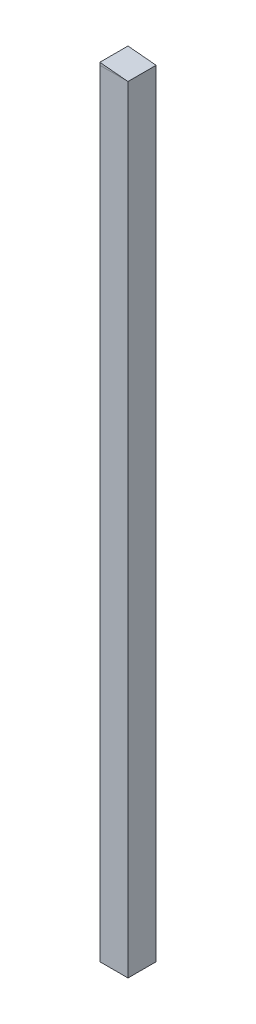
from build123d import *

# Parameters (mm, degrees)
ESQUISSE1_W      = 10
ESQUISSE1_H      = 10
EXTRUSION1_DEPTH = 275.72
EXTRUSION2_DEPTH = 10


with BuildPart() as part:
    # Esquisse1 → Extrusion1 (new body)
    with BuildSketch(Plane(origin=(0, 0, 0), x_dir=(1, 0, 0), z_dir=(0, 1, 0))):
        with Locations((5, 5)):
            Rectangle(ESQUISSE1_W, ESQUISSE1_H)
    extrude(amount=EXTRUSION1_DEPTH)


with BuildPart() as body_2:
    # Esquisse2 → Extrusion2 (new body)
    with BuildSketch(Plane.XY):
        Polygon((10, 275.716184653), (0, 276.645964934), (0, 275.720020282), align=None)
    extrude(amount=-EXTRUSION2_DEPTH)


solid = Compound([part.part, body_2.part])
